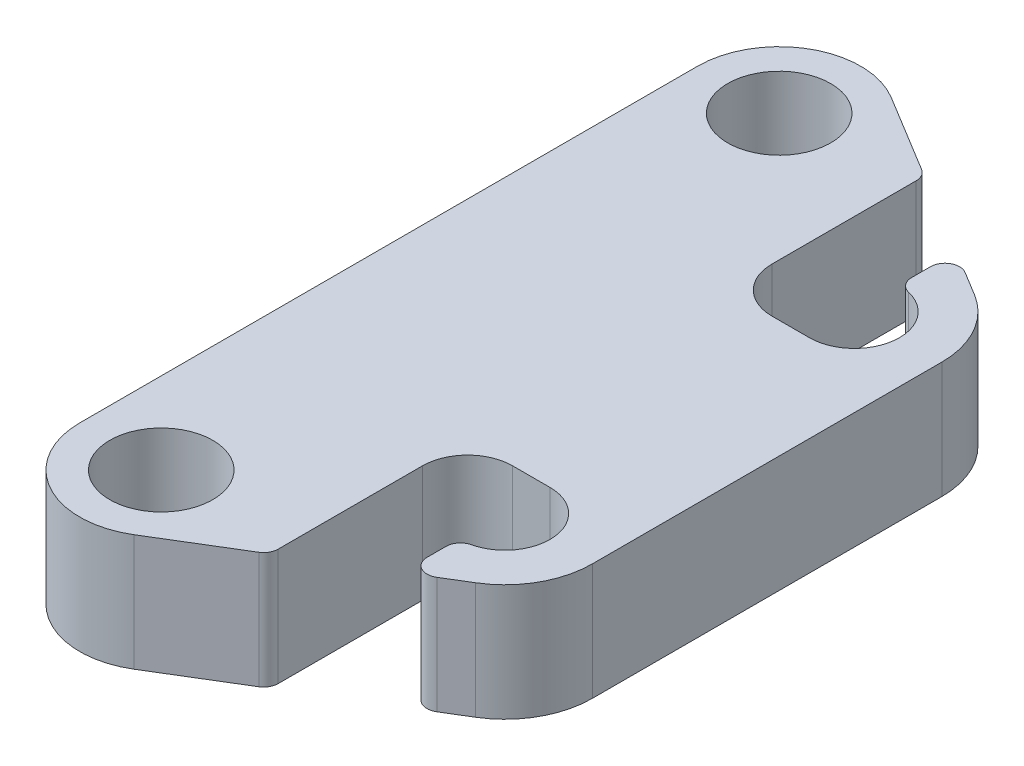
from build123d import *

# Parameters (mm, degrees)
BOSS_EXTRUDE3_DEPTH          = 6.35
F_2_0_221_DIAMETER_HOLE1_D   = 5.6134
F_10_0_1935_DIAMETER_HOLE1_D = 4.9149
CUT_EXTRUDE1_DEPTH           = 28.480323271
FILLET2_R                    = 0.79375


with BuildPart() as part:
    # Sketch12 → Boss-Extrude3 (new body)
    with BuildSketch(Plane(origin=(0, 0, 0), x_dir=(1, 0, 0), z_dir=(0, 1, 0))):
        with BuildLine():
            Line((16.1798, 9.525), (16.1798, -9.525))
            ThreePointArc((16.1798, -9.525), (15.568626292, -11.859072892), (13.891969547, -13.594080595))
            Line((13.891969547, -13.594080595), (2.309691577, -20.638008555))
            ThreePointArc((2.309691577, -20.638008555), (-2.178468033, -20.714771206), (-4.445, -16.8402))
            Line((-4.445, -16.8402), (-4.445, 16.8402))
            ThreePointArc((-4.445, 16.8402), (-2.178468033, 20.714771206), (2.309691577, 20.638008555))
            Line((2.309691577, 20.638008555), (13.891969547, 13.594080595))
            ThreePointArc((13.891969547, 13.594080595), (15.568626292, 11.859072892), (16.1798, 9.525))
        make_face()
    extrude(amount=BOSS_EXTRUDE3_DEPTH)

    # 2 _0.221_ Diameter Hole1 (through all)
    with Locations(Plane(origin=(0, 0, 0), x_dir=(-1, 0, 0), z_dir=(0, -1, 0))):
        with Locations((0, -16.8402), (0, 16.8402)):
            Hole(F_2_0_221_DIAMETER_HOLE1_D / 2)

    # 10 _0.1935_ Diameter Hole1 (through all)
    with Locations(Plane(origin=(0, 0, 0), x_dir=(-1, 0, 0), z_dir=(0, -1, 0))):
        with Locations((-11.4173, -9.525), (-11.4173, 9.525)):
            Hole(F_10_0_1935_DIAMETER_HOLE1_D / 2)

    # Sketch17 → Cut-Extrude1 (cut, through all)
    with BuildSketch(Plane.XZ.offset(-6.35)):
        with BuildLine():
            Line((11.4173, 7.06755), (9.37895, 7.06755))
            ThreePointArc((9.37895, 7.06755), (7.641270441, 7.787320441), (6.9215, 9.525))
            Line((6.9215, 9.525), (6.9215, 17.833271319))
            Line((6.9215, 17.833271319), (11.3665, 15.129981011))
            Line((11.3665, 15.129981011), (11.3665, 11.98245))
            Line((11.3665, 11.98245), (11.4173, 11.98245))
            ThreePointArc((11.4173, 11.98245), (13.87475, 9.525), (11.4173, 7.06755))
        make_face()
        with BuildLine():
            Line((11.3665, -11.98245), (11.3665, -15.129981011))
            Line((11.3665, -15.129981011), (6.9215, -17.833271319))
            Line((6.9215, -17.833271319), (6.9215, -9.525))
            ThreePointArc((6.9215, -9.525), (7.641270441, -7.787320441), (9.37895, -7.06755))
            Line((9.37895, -7.06755), (11.4173, -7.06755))
            ThreePointArc((11.4173, -7.06755), (13.87475, -9.525), (11.4173, -11.98245))
            Line((11.4173, -11.98245), (11.3665, -11.98245))
        make_face()
    extrude(amount=CUT_EXTRUDE1_DEPTH, mode=Mode.SUBTRACT)

    # Fillet2
    fillet2_edges = [part.edges().sort_by_distance(p)[0] for p in [
        (6.9215, 3.175, 17.833271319),
        (11.3665, 3.175, 15.129981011),
        (11.3665, 3.175, 11.98245),
        (11.3665, 3.175, -11.98245),
        (11.3665, 3.175, -15.129981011),
        (6.9215, 3.175, -17.833271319),
    ]]
    fillet(fillet2_edges, radius=FILLET2_R)


solid = part.part
